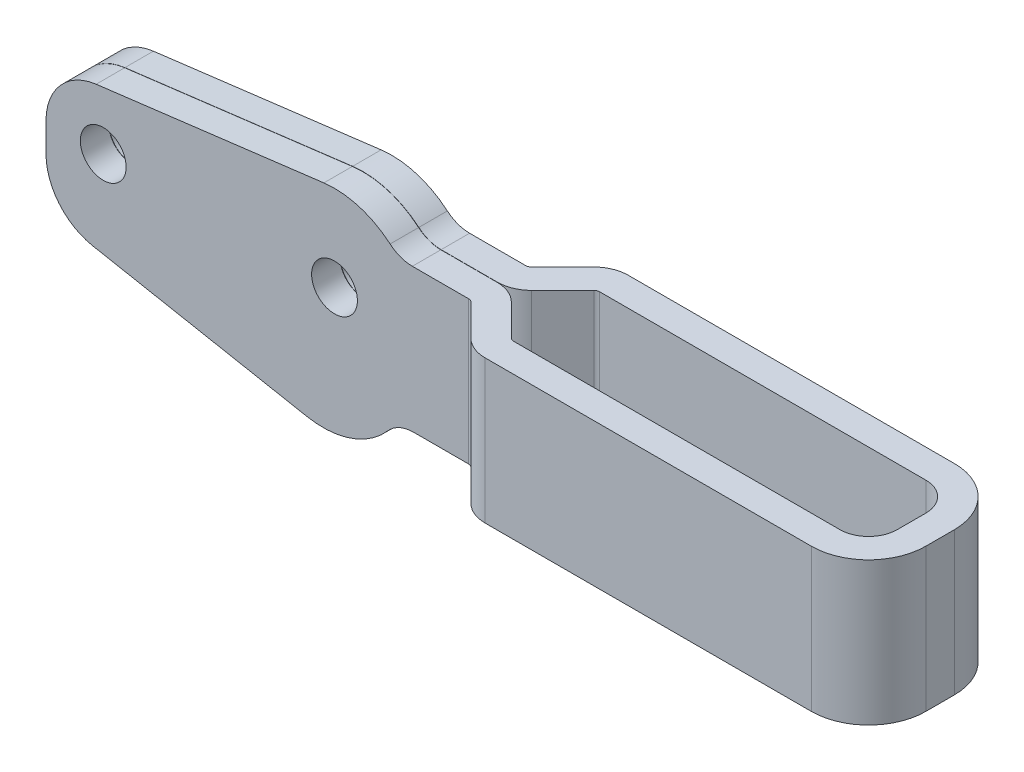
from build123d import *

# Parameters (mm, degrees)
SKETCH1_W               = 96.012
SKETCH1_H               = 15.875
BASE_EXTRUDE_DEPTH      = 7.9375
CUT_EXTRUDE1_DEPTH      = 98.638740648
FILLET5_R               = 0.635
FILLET6_R               = 3.81
FILLET7_R               = 3.175
FILLET8_R               = 6.35
FILLET9_R               = 6.35
FILLET10_R              = 6.35
BOSS_EXTRUDE3_START     = -6.35
BOSS_EXTRUDE3_DEPTH     = 6.35
FILLET11_R              = 3.81
SKETCH7_R               = 2.54
CUT_EXTRUDE5_DEPTH      = 99.512406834
CUT_EXTRUDE6_DEPTH      = 99.485470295
CUT_EXTRUDE6_DEPTH_BACK = 99.485470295
SKETCH8_W               = 56.651025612
SKETCH8_H               = 0.0254
FILLET12_R              = 3.81
FILLET13_R              = 3.81


with BuildPart() as part:
    # Sketch1 → Base-Extrude (new, symmetric)
    with BuildSketch(Plane.XY):
        with Locations((48.006, 7.9375)):
            Rectangle(SKETCH1_W, SKETCH1_H)
    extrude(amount=BASE_EXTRUDE_DEPTH, both=True)

    # Sketch3 → Cut-Extrude1 (cut, through all)
    with BuildSketch(Plane(origin=(0, 15.875, 0), x_dir=(-1, 0, 0), z_dir=(0, 1, 0))):
        Polygon((-53.213, -4.7625), (-92.837, -4.7625), (-92.837, 4.7625), (-53.213, 4.7625), (-48.4505, 0), align=None)
        Polygon((2.11806403, -3.175), (-47.135371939, -3.175), (-55.848364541, -11.887992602), (2.11806403, -11.887992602), align=None)
        Polygon((2.11806403, 3.175), (-47.135371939, 3.175), (-55.848364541, 11.887992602), (2.11806403, 11.887992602), align=None)
    extrude(amount=-CUT_EXTRUDE1_DEPTH, mode=Mode.SUBTRACT)

    # Fillet5
    fillet5_edges = [part.edges().sort_by_distance(p)[0] for p in [
        (53.213, 7.9375, -4.7625),
        (53.213, 7.9375, 4.7625),
        (47.135371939, 7.9375, 3.175),
        (47.135371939, 7.9375, -3.175),
    ]]
    fillet(fillet5_edges, radius=FILLET5_R)

    # Fillet6
    fillet6_edges = [part.edges().sort_by_distance(p)[0] for p in [
        (51.897871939, 7.9375, 7.9375),
        (51.897871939, 7.9375, -7.9375),
    ]]
    fillet(fillet6_edges, radius=FILLET6_R)

    # Fillet7
    fillet7_edges = [part.edges().sort_by_distance(p)[0] for p in [
        (92.837, 7.9375, -4.7625),
        (92.837, 7.9375, 4.7625),
    ]]
    fillet(fillet7_edges, radius=FILLET7_R)

    # Fillet8
    fillet8_edges = [part.edges().sort_by_distance(p)[0] for p in [
        (96.012, 7.9375, 7.9375),
        (96.012, 7.9375, -7.9375),
    ]]
    fillet(fillet8_edges, radius=FILLET8_R)

    # Fillet9
    fillet9_edges = [part.edges().sort_by_distance(p)[0] for p in [
        (0, 15.875, 0),
    ]]
    fillet(fillet9_edges, radius=FILLET9_R)

    # Fillet10
    fillet10_edges = [part.edges().sort_by_distance(p)[0] for p in [
        (0, 0, 0),
    ]]
    fillet(fillet10_edges, radius=FILLET10_R)

    # Sketch6 → Boss-Extrude3 (add)
    with BuildSketch(Plane.XY.offset(3.175).offset(BOSS_EXTRUDE3_START)):
        with BuildLine():
            Line((5.564108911, 15.826180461), (30.825163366, 18.976770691))
            ThreePointArc((30.825163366, 18.976770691), (39.943880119, 14.786551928), (40.249024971, 4.755808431))
            ThreePointArc((40.249024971, 4.755808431), (36.72434383, -2.446073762), (28.949130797, -4.404784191))
            Line((28.949130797, -4.404784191), (5.165376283, 0.111477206))
            ThreePointArc((5.165376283, 0.111477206), (1.458943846, 2.300300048), (0, 6.35))
            Line((0, 6.35), (0, 9.525))
            ThreePointArc((0, 9.525), (1.590120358, 13.728099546), (5.564108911, 15.826180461))
        make_face()
    extrude(amount=BOSS_EXTRUDE3_DEPTH)

    # Fillet11
    fillet11_edges = [part.edges().sort_by_distance(p)[0] for p in [
        (38.862, 0, 0),
        (39.103515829, 15.875, 0),
    ]]
    fillet(fillet11_edges, radius=FILLET11_R)

    # Sketch7 → Cut-Extrude5 (cut, through all)
    with BuildSketch(Plane.XY.offset(3.175)):
        with Locations((6.35, 9.525)):
            Circle(SKETCH7_R)
        with Locations((32.004, 9.525)):
            Circle(SKETCH7_R)
    extrude(amount=-CUT_EXTRUDE5_DEPTH, mode=Mode.SUBTRACT)

    # Sketch8 → Cut-Extrude6 (cut, two sides: drawn at the far end of the back side and taken through both)
    with BuildSketch(Plane(origin=(0, 15.875, 0), x_dir=(-1, 0, 0), z_dir=(0, 1, 0)).offset(-CUT_EXTRUDE6_DEPTH_BACK)):
        with Locations((-25.150512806, 0)):
            Rectangle(SKETCH8_W, SKETCH8_H)
    extrude(amount=CUT_EXTRUDE6_DEPTH + CUT_EXTRUDE6_DEPTH_BACK, mode=Mode.SUBTRACT)

    # Fillet12
    fillet12_edges = [part.edges().sort_by_distance(p)[0] for p in [
        (48.4632, 7.9375, 0.0127),
    ]]
    fillet(fillet12_edges, radius=FILLET12_R)

    # Fillet13
    fillet13_edges = [part.edges().sort_by_distance(p)[0] for p in [
        (48.4632, 7.9375, -0.0127),
    ]]
    fillet(fillet13_edges, radius=FILLET13_R)


solid = part.part
